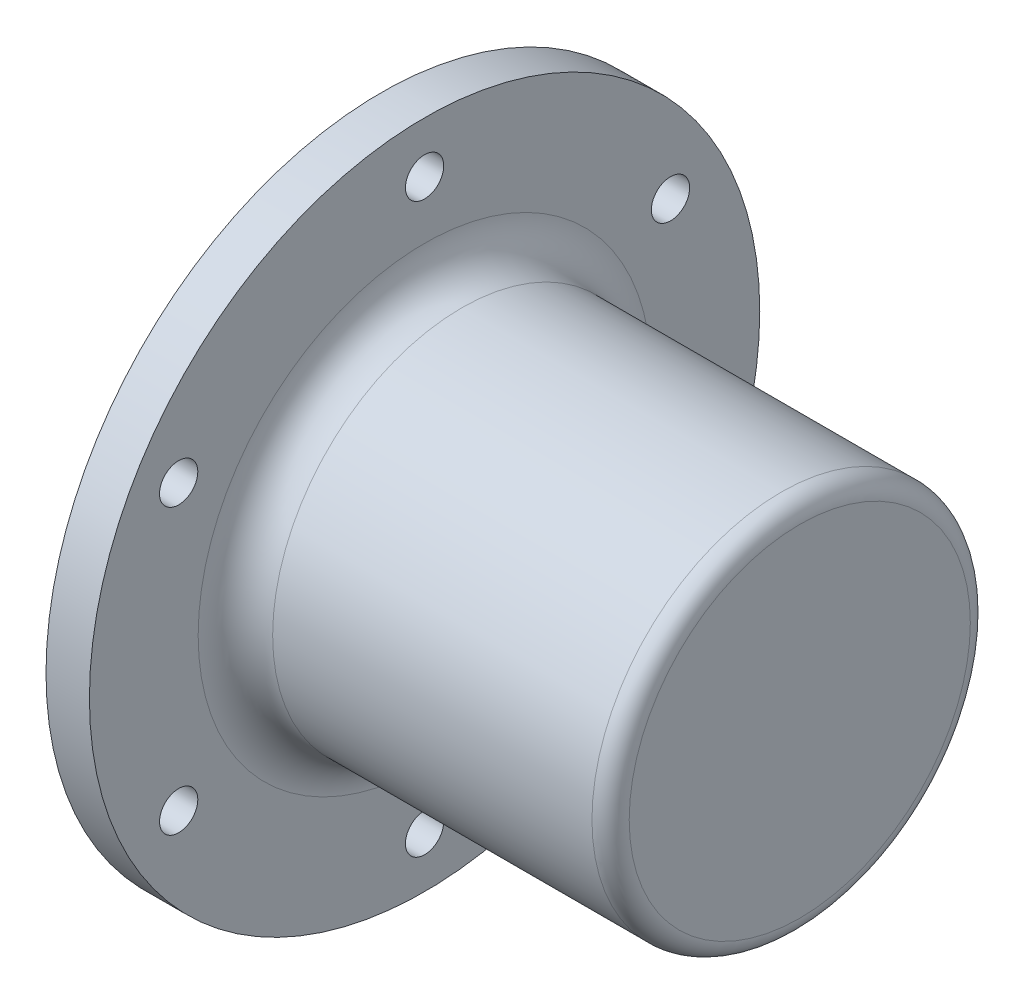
from build123d import *

# Parameters (mm, degrees)
F_4_CLEARANCE_HOLE1_D = 3.2639
CIRPATTERN1_COUNT     = 6
FILLET1_R             = 3.175
FILLET2_R             = 1.5875


with BuildPart() as part:
    # Sketch1 → Revolve1 (revolve)
    with BuildSketch(Plane.XY, mode=Mode.PRIVATE) as revolve1_sk:
        Polygon((26.254973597, 28.575), (26.254973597, 16.129), (58.241115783, 16.129), (58.241115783, 0), (55.447115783, 0), (55.447115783, 15.24), (22.554115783, 15.24), (22.554115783, 28.575), align=None)
    revolve(revolve1_sk.sketch.rotate(Axis((0, 0, 0), (1, 0, 0)), 90), axis=Axis((0, 0, 0), (1, 0, 0)))

    # Sketch4 → Groove for AS 568-026_ O-Ring1 (revolve, cut)
    with BuildSketch(Plane(origin=(22.554115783, 0, 0), x_dir=(0, 1, 0), z_dir=(0, 0, 1)), mode=Mode.PRIVATE) as groove_for_as_568_026_o_ring1_sk:
        with BuildLine():
            Line((15.715014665, -1.038137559), (15.624189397, 0))
            Line((15.624189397, 0), (18.157810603, 0))
            Line((18.157810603, 0), (18.066985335, -1.038137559))
            ThreePointArc((18.066985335, -1.038137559), (17.985551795, -1.203268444), (17.813951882, -1.27))
            Line((17.813951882, -1.27), (15.968048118, -1.27))
            ThreePointArc((15.968048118, -1.27), (15.796448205, -1.203268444), (15.715014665, -1.038137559))
        make_face()
    revolve(groove_for_as_568_026_o_ring1_sk.sketch.rotate(Axis((-27.445884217, 0, 0), (1, 0, 0)), 270), axis=Axis((-27.445884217, 0, 0), (1, 0, 0)), mode=Mode.SUBTRACT)

    # Sketch5 → Groove for AS 568-029_ O-Ring1 (revolve, cut)
    with BuildSketch(Plane(origin=(22.554115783, 0, 0), x_dir=(0, 1, 0), z_dir=(0, 0, 1)), mode=Mode.PRIVATE) as groove_for_as_568_029_o_ring1_sk:
        with BuildLine():
            Line((18.890014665, -1.038137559), (18.799189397, 0))
            Line((18.799189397, 0), (21.586810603, 0))
            Line((21.586810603, 0), (21.495985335, -1.038137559))
            ThreePointArc((21.495985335, -1.038137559), (21.414551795, -1.203268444), (21.242951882, -1.27))
            Line((21.242951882, -1.27), (19.143048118, -1.27))
            ThreePointArc((19.143048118, -1.27), (18.971448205, -1.203268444), (18.890014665, -1.038137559))
        make_face()
    revolve(groove_for_as_568_029_o_ring1_sk.sketch.rotate(Axis((-27.445884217, 0, 0), (1, 0, 0)), 270), axis=Axis((-27.445884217, 0, 0), (1, 0, 0)), mode=Mode.SUBTRACT)

    # 4 Clearance Hole1 (through all)
    with Locations(Plane(origin=(26.254973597, 0, 0), x_dir=(0, 0, -1), z_dir=(1, 0, 0))):
        with Locations((0, 24.209375)):
            f_4_clearance_hole1 = Hole(F_4_CLEARANCE_HOLE1_D / 2)

    # CirPattern1: 4 Clearance Hole1 ×6 about axis
    cirpattern1_axis = Axis((0, 0, 0), (1, 0, 0))
    for i in range(1, CIRPATTERN1_COUNT):
        add(f_4_clearance_hole1.rotate(cirpattern1_axis, i * 360 / CIRPATTERN1_COUNT), mode=Mode.SUBTRACT)

    # Fillet1
    fillet1_edges = [part.edges().sort_by_distance(p)[0] for p in [
        (26.254973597, 0, -16.129),
    ]]
    fillet(fillet1_edges, radius=FILLET1_R)

    # Fillet2
    fillet2_edges = [part.edges().sort_by_distance(p)[0] for p in [
        (55.447115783, 0, -15.24),
        (58.241115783, 0, -16.129),
    ]]
    fillet(fillet2_edges, radius=FILLET2_R)


solid = part.part
